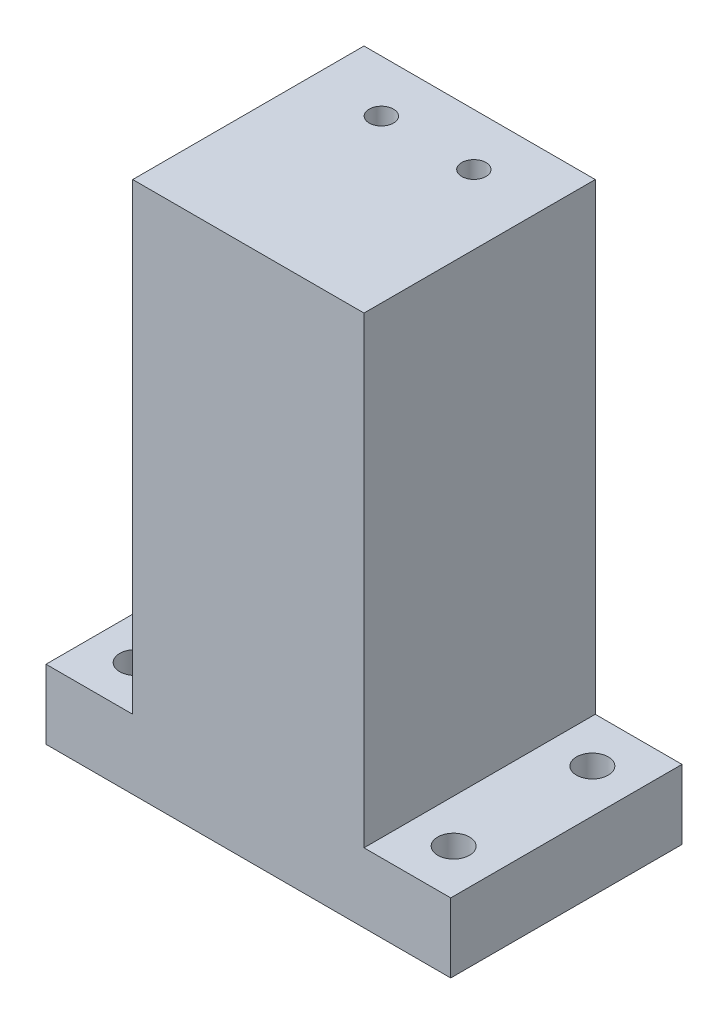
ISO-10303-21;
HEADER;
FILE_DESCRIPTION(('STEP AP214'),'2;1');
FILE_NAME('part.step','',(''),(''),'','','');
FILE_SCHEMA(('AUTOMOTIVE_DESIGN { 1 0 10303 214 1 1 1 1 }'));
ENDSEC;
DATA;
#1=APPLICATION_CONTEXT('core data for automotive mechanical design processes');
#2=APPLICATION_PROTOCOL_DEFINITION('international standard','automotive_design',2000,#1);
#3=PRODUCT_CONTEXT('',#1,'mechanical');
#4=PRODUCT('Part','Part','',(#3));
#5=PRODUCT_RELATED_PRODUCT_CATEGORY('part','',(#4));
#6=PRODUCT_DEFINITION_FORMATION('','',#4);
#7=PRODUCT_DEFINITION_CONTEXT('part definition',#1,'design');
#8=PRODUCT_DEFINITION('design','',#6,#7);
#9=PRODUCT_DEFINITION_SHAPE('','',#8);
#10=(LENGTH_UNIT() NAMED_UNIT(*) SI_UNIT(.MILLI.,.METRE.));
#11=(NAMED_UNIT(*) PLANE_ANGLE_UNIT() SI_UNIT($,.RADIAN.));
#12=(NAMED_UNIT(*) SI_UNIT($,.STERADIAN.) SOLID_ANGLE_UNIT());
#13=UNCERTAINTY_MEASURE_WITH_UNIT(LENGTH_MEASURE(1.E-05),#10,'distance_accuracy_value','');
#14=(GEOMETRIC_REPRESENTATION_CONTEXT(3) GLOBAL_UNCERTAINTY_ASSIGNED_CONTEXT((#13)) GLOBAL_UNIT_ASSIGNED_CONTEXT((#10,
#11,#12)) REPRESENTATION_CONTEXT('',''));
#15=CARTESIAN_POINT('',(0.,0.,0.));
#16=DIRECTION('',(0.,0.,1.));
#17=DIRECTION('',(1.,0.,0.));
#18=AXIS2_PLACEMENT_3D('',#15,#16,#17);
#19=CARTESIAN_POINT('',(0.,11.9999999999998,40.));
#20=DIRECTION('',(0.,-1.,0.));
#21=DIRECTION('',(0.,0.,-1.));
#22=AXIS2_PLACEMENT_3D('',#19,#20,#21);
#23=PLANE('',#22);
#24=CARTESIAN_POINT('',(7.5,11.9999999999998,8.));
#25=DIRECTION('',(0.,1.,0.));
#26=DIRECTION('',(0.,0.,1.));
#27=AXIS2_PLACEMENT_3D('',#24,#25,#26);
#28=CIRCLE('',#27,2.75);
#29=CARTESIAN_POINT('',(7.5,11.9999999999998,10.75));
#30=VERTEX_POINT('',#29);
#31=EDGE_CURVE('E170',#30,#30,#28,.T.);
#32=ORIENTED_EDGE('',*,*,#31,.F.);
#33=EDGE_LOOP('',(#32));
#34=FACE_BOUND('',#33,.T.);
#35=CARTESIAN_POINT('',(7.5,11.9999999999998,32.));
#36=DIRECTION('',(0.,1.,0.));
#37=DIRECTION('',(0.,0.,1.));
#38=AXIS2_PLACEMENT_3D('',#35,#36,#37);
#39=CIRCLE('',#38,2.75);
#40=CARTESIAN_POINT('',(7.5,11.9999999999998,34.75));
#41=VERTEX_POINT('',#40);
#42=EDGE_CURVE('E159',#41,#41,#39,.T.);
#43=ORIENTED_EDGE('',*,*,#42,.F.);
#44=EDGE_LOOP('',(#43));
#45=FACE_BOUND('',#44,.T.);
#46=DIRECTION('',(-1.,0.,0.));
#47=VECTOR('',#46,1.);
#48=CARTESIAN_POINT('',(0.,11.9999999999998,0.));
#49=LINE('',#48,#47);
#50=CARTESIAN_POINT('',(15.,11.9999999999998,0.));
#51=VERTEX_POINT('',#50);
#52=CARTESIAN_POINT('',(0.,11.9999999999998,0.));
#53=VERTEX_POINT('',#52);
#54=EDGE_CURVE('E130',#51,#53,#49,.T.);
#55=ORIENTED_EDGE('',*,*,#54,.T.);
#56=DIRECTION('',(0.,0.,-1.));
#57=VECTOR('',#56,1.);
#58=CARTESIAN_POINT('',(0.,11.9999999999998,40.));
#59=LINE('',#58,#57);
#60=CARTESIAN_POINT('',(0.,11.9999999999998,40.));
#61=VERTEX_POINT('',#60);
#62=EDGE_CURVE('E11',#61,#53,#59,.T.);
#63=ORIENTED_EDGE('',*,*,#62,.F.);
#64=DIRECTION('',(-1.,0.,0.));
#65=VECTOR('',#64,1.);
#66=CARTESIAN_POINT('',(0.,11.9999999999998,40.));
#67=LINE('',#66,#65);
#68=CARTESIAN_POINT('',(15.,11.9999999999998,40.));
#69=VERTEX_POINT('',#68);
#70=EDGE_CURVE('E145',#69,#61,#67,.T.);
#71=ORIENTED_EDGE('',*,*,#70,.F.);
#72=DIRECTION('',(0.,0.,-1.));
#73=VECTOR('',#72,1.);
#74=CARTESIAN_POINT('',(15.,11.9999999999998,40.));
#75=LINE('',#74,#73);
#76=EDGE_CURVE('E126',#69,#51,#75,.T.);
#77=ORIENTED_EDGE('',*,*,#76,.T.);
#78=EDGE_LOOP('',(#55,#63,#71,#77));
#79=FACE_BOUND('',#78,.T.);
#80=ADVANCED_FACE('F32',(#34,#45,#79),#23,.F.);
#81=CARTESIAN_POINT('',(0.,0.,40.));
#82=DIRECTION('',(1.,0.,0.));
#83=DIRECTION('',(0.,0.,-1.));
#84=AXIS2_PLACEMENT_3D('',#81,#82,#83);
#85=PLANE('',#84);
#86=DIRECTION('',(0.,-1.,0.));
#87=VECTOR('',#86,1.);
#88=CARTESIAN_POINT('',(0.,0.,0.));
#89=LINE('',#88,#87);
#90=CARTESIAN_POINT('',(0.,0.,0.));
#91=VERTEX_POINT('',#90);
#92=EDGE_CURVE('E133',#53,#91,#89,.T.);
#93=ORIENTED_EDGE('',*,*,#92,.T.);
#94=DIRECTION('',(0.,0.,-1.));
#95=VECTOR('',#94,1.);
#96=CARTESIAN_POINT('',(0.,0.,40.));
#97=LINE('',#96,#95);
#98=CARTESIAN_POINT('',(0.,0.,40.));
#99=VERTEX_POINT('',#98);
#100=EDGE_CURVE('E41',#99,#91,#97,.T.);
#101=ORIENTED_EDGE('',*,*,#100,.F.);
#102=DIRECTION('',(0.,-1.,0.));
#103=VECTOR('',#102,1.);
#104=CARTESIAN_POINT('',(0.,0.,40.));
#105=LINE('',#104,#103);
#106=EDGE_CURVE('E93',#61,#99,#105,.T.);
#107=ORIENTED_EDGE('',*,*,#106,.F.);
#108=ORIENTED_EDGE('',*,*,#62,.T.);
#109=EDGE_LOOP('',(#93,#101,#107,#108));
#110=FACE_BOUND('',#109,.T.);
#111=ADVANCED_FACE('F215',(#110),#85,.F.);
#112=CARTESIAN_POINT('',(0.,0.,40.));
#113=DIRECTION('',(0.,1.,0.));
#114=DIRECTION('',(0.,0.,1.));
#115=AXIS2_PLACEMENT_3D('',#112,#113,#114);
#116=PLANE('',#115);
#117=CARTESIAN_POINT('',(7.5,0.,8.));
#118=DIRECTION('',(0.,1.,0.));
#119=DIRECTION('',(0.,0.,1.));
#120=AXIS2_PLACEMENT_3D('',#117,#118,#119);
#121=CIRCLE('',#120,2.75);
#122=CARTESIAN_POINT('',(7.5,0.,10.75));
#123=VERTEX_POINT('',#122);
#124=EDGE_CURVE('E35',#123,#123,#121,.T.);
#125=ORIENTED_EDGE('',*,*,#124,.T.);
#126=EDGE_LOOP('',(#125));
#127=FACE_BOUND('',#126,.T.);
#128=CARTESIAN_POINT('',(7.5,0.,32.));
#129=DIRECTION('',(0.,1.,0.));
#130=DIRECTION('',(0.,0.,1.));
#131=AXIS2_PLACEMENT_3D('',#128,#129,#130);
#132=CIRCLE('',#131,2.75);
#133=CARTESIAN_POINT('',(7.5,0.,34.75));
#134=VERTEX_POINT('',#133);
#135=EDGE_CURVE('E156',#134,#134,#132,.T.);
#136=ORIENTED_EDGE('',*,*,#135,.T.);
#137=EDGE_LOOP('',(#136));
#138=FACE_BOUND('',#137,.T.);
#139=CARTESIAN_POINT('',(62.5000000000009,0.,32.));
#140=DIRECTION('',(0.,1.,0.));
#141=DIRECTION('',(0.,0.,1.));
#142=AXIS2_PLACEMENT_3D('',#139,#140,#141);
#143=CIRCLE('',#142,2.75);
#144=CARTESIAN_POINT('',(62.5000000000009,0.,34.75));
#145=VERTEX_POINT('',#144);
#146=EDGE_CURVE('E163',#145,#145,#143,.T.);
#147=ORIENTED_EDGE('',*,*,#146,.T.);
#148=EDGE_LOOP('',(#147));
#149=FACE_BOUND('',#148,.T.);
#150=CARTESIAN_POINT('',(62.5000000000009,0.,8.));
#151=DIRECTION('',(0.,1.,0.));
#152=DIRECTION('',(0.,0.,1.));
#153=AXIS2_PLACEMENT_3D('',#150,#151,#152);
#154=CIRCLE('',#153,2.75);
#155=CARTESIAN_POINT('',(62.5000000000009,0.,10.75));
#156=VERTEX_POINT('',#155);
#157=EDGE_CURVE('E134',#156,#156,#154,.T.);
#158=ORIENTED_EDGE('',*,*,#157,.T.);
#159=EDGE_LOOP('',(#158));
#160=FACE_BOUND('',#159,.T.);
#161=DIRECTION('',(1.,0.,0.));
#162=VECTOR('',#161,1.);
#163=CARTESIAN_POINT('',(0.,0.,0.));
#164=LINE('',#163,#162);
#165=CARTESIAN_POINT('',(70.0000000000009,0.,0.));
#166=VERTEX_POINT('',#165);
#167=EDGE_CURVE('E136',#91,#166,#164,.T.);
#168=ORIENTED_EDGE('',*,*,#167,.T.);
#169=DIRECTION('',(0.,0.,-1.));
#170=VECTOR('',#169,1.);
#171=CARTESIAN_POINT('',(70.0000000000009,0.,40.));
#172=LINE('',#171,#170);
#173=CARTESIAN_POINT('',(70.0000000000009,0.,40.));
#174=VERTEX_POINT('',#173);
#175=EDGE_CURVE('E152',#174,#166,#172,.T.);
#176=ORIENTED_EDGE('',*,*,#175,.F.);
#177=DIRECTION('',(1.,0.,0.));
#178=VECTOR('',#177,1.);
#179=CARTESIAN_POINT('',(0.,0.,40.));
#180=LINE('',#179,#178);
#181=EDGE_CURVE('E183',#99,#174,#180,.T.);
#182=ORIENTED_EDGE('',*,*,#181,.F.);
#183=ORIENTED_EDGE('',*,*,#100,.T.);
#184=EDGE_LOOP('',(#168,#176,#182,#183));
#185=FACE_BOUND('',#184,.T.);
#186=ADVANCED_FACE('F220',(#127,#138,#149,#160,#185),#116,.F.);
#187=CARTESIAN_POINT('',(70.0000000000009,0.,40.));
#188=DIRECTION('',(-1.,0.,0.));
#189=DIRECTION('',(0.,0.,1.));
#190=AXIS2_PLACEMENT_3D('',#187,#188,#189);
#191=PLANE('',#190);
#192=DIRECTION('',(0.,1.,0.));
#193=VECTOR('',#192,1.);
#194=CARTESIAN_POINT('',(70.0000000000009,0.,0.));
#195=LINE('',#194,#193);
#196=CARTESIAN_POINT('',(70.0000000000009,11.9999999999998,0.));
#197=VERTEX_POINT('',#196);
#198=EDGE_CURVE('E138',#166,#197,#195,.T.);
#199=ORIENTED_EDGE('',*,*,#198,.T.);
#200=DIRECTION('',(0.,0.,-1.));
#201=VECTOR('',#200,1.);
#202=CARTESIAN_POINT('',(70.0000000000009,11.9999999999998,40.));
#203=LINE('',#202,#201);
#204=CARTESIAN_POINT('',(70.0000000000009,11.9999999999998,40.));
#205=VERTEX_POINT('',#204);
#206=EDGE_CURVE('E149',#205,#197,#203,.T.);
#207=ORIENTED_EDGE('',*,*,#206,.F.);
#208=DIRECTION('',(0.,1.,0.));
#209=VECTOR('',#208,1.);
#210=CARTESIAN_POINT('',(70.0000000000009,0.,40.));
#211=LINE('',#210,#209);
#212=EDGE_CURVE('E185',#174,#205,#211,.T.);
#213=ORIENTED_EDGE('',*,*,#212,.F.);
#214=ORIENTED_EDGE('',*,*,#175,.T.);
#215=EDGE_LOOP('',(#199,#207,#213,#214));
#216=FACE_BOUND('',#215,.T.);
#217=ADVANCED_FACE('F191',(#216),#191,.F.);
#218=CARTESIAN_POINT('',(55.,11.9999999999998,40.));
#219=DIRECTION('',(0.,-1.,0.));
#220=DIRECTION('',(0.,0.,-1.));
#221=AXIS2_PLACEMENT_3D('',#218,#219,#220);
#222=PLANE('',#221);
#223=CARTESIAN_POINT('',(62.5000000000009,11.9999999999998,32.));
#224=DIRECTION('',(0.,1.,0.));
#225=DIRECTION('',(0.,0.,1.));
#226=AXIS2_PLACEMENT_3D('',#223,#224,#225);
#227=CIRCLE('',#226,2.75);
#228=CARTESIAN_POINT('',(62.5000000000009,11.9999999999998,34.75));
#229=VERTEX_POINT('',#228);
#230=EDGE_CURVE('E158',#229,#229,#227,.T.);
#231=ORIENTED_EDGE('',*,*,#230,.F.);
#232=EDGE_LOOP('',(#231));
#233=FACE_BOUND('',#232,.T.);
#234=CARTESIAN_POINT('',(62.5000000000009,11.9999999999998,8.));
#235=DIRECTION('',(0.,1.,0.));
#236=DIRECTION('',(0.,0.,1.));
#237=AXIS2_PLACEMENT_3D('',#234,#235,#236);
#238=CIRCLE('',#237,2.75);
#239=CARTESIAN_POINT('',(62.5000000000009,11.9999999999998,10.75));
#240=VERTEX_POINT('',#239);
#241=EDGE_CURVE('E176',#240,#240,#238,.T.);
#242=ORIENTED_EDGE('',*,*,#241,.F.);
#243=EDGE_LOOP('',(#242));
#244=FACE_BOUND('',#243,.T.);
#245=DIRECTION('',(-1.,0.,0.));
#246=VECTOR('',#245,1.);
#247=CARTESIAN_POINT('',(55.,11.9999999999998,0.));
#248=LINE('',#247,#246);
#249=CARTESIAN_POINT('',(55.,11.9999999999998,0.));
#250=VERTEX_POINT('',#249);
#251=EDGE_CURVE('E140',#197,#250,#248,.T.);
#252=ORIENTED_EDGE('',*,*,#251,.T.);
#253=DIRECTION('',(0.,0.,-1.));
#254=VECTOR('',#253,1.);
#255=CARTESIAN_POINT('',(55.,11.9999999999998,40.));
#256=LINE('',#255,#254);
#257=CARTESIAN_POINT('',(55.,11.9999999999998,40.));
#258=VERTEX_POINT('',#257);
#259=EDGE_CURVE('E121',#258,#250,#256,.T.);
#260=ORIENTED_EDGE('',*,*,#259,.F.);
#261=DIRECTION('',(-1.,0.,0.));
#262=VECTOR('',#261,1.);
#263=CARTESIAN_POINT('',(55.,11.9999999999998,40.));
#264=LINE('',#263,#262);
#265=EDGE_CURVE('E112',#205,#258,#264,.T.);
#266=ORIENTED_EDGE('',*,*,#265,.F.);
#267=ORIENTED_EDGE('',*,*,#206,.T.);
#268=EDGE_LOOP('',(#252,#260,#266,#267));
#269=FACE_BOUND('',#268,.T.);
#270=ADVANCED_FACE('F195',(#233,#244,#269),#222,.F.);
#271=CARTESIAN_POINT('',(55.,11.9999999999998,40.));
#272=DIRECTION('',(-1.,0.,0.));
#273=DIRECTION('',(0.,0.,1.));
#274=AXIS2_PLACEMENT_3D('',#271,#272,#273);
#275=PLANE('',#274);
#276=DIRECTION('',(0.,1.,0.));
#277=VECTOR('',#276,1.);
#278=CARTESIAN_POINT('',(55.,11.9999999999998,0.));
#279=LINE('',#278,#277);
#280=CARTESIAN_POINT('',(55.,92.1000000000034,0.));
#281=VERTEX_POINT('',#280);
#282=EDGE_CURVE('E120',#250,#281,#279,.T.);
#283=ORIENTED_EDGE('',*,*,#282,.T.);
#284=DIRECTION('',(0.,0.,-1.));
#285=VECTOR('',#284,1.);
#286=CARTESIAN_POINT('',(55.,92.1000000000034,40.));
#287=LINE('',#286,#285);
#288=CARTESIAN_POINT('',(55.,92.1000000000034,40.));
#289=VERTEX_POINT('',#288);
#290=EDGE_CURVE('E117',#289,#281,#287,.T.);
#291=ORIENTED_EDGE('',*,*,#290,.F.);
#292=DIRECTION('',(0.,1.,0.));
#293=VECTOR('',#292,1.);
#294=CARTESIAN_POINT('',(55.,11.9999999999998,40.));
#295=LINE('',#294,#293);
#296=EDGE_CURVE('E106',#258,#289,#295,.T.);
#297=ORIENTED_EDGE('',*,*,#296,.F.);
#298=ORIENTED_EDGE('',*,*,#259,.T.);
#299=EDGE_LOOP('',(#283,#291,#297,#298));
#300=FACE_BOUND('',#299,.T.);
#301=ADVANCED_FACE('F118',(#300),#275,.F.);
#302=CARTESIAN_POINT('',(15.,92.1000000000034,40.));
#303=DIRECTION('',(0.,-1.,0.));
#304=DIRECTION('',(0.,0.,-1.));
#305=AXIS2_PLACEMENT_3D('',#302,#303,#304);
#306=PLANE('',#305);
#307=CARTESIAN_POINT('',(43.,92.1000000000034,9.));
#308=DIRECTION('',(0.,1.,0.));
#309=DIRECTION('',(0.,0.,1.));
#310=AXIS2_PLACEMENT_3D('',#307,#308,#309);
#311=CIRCLE('',#310,2.09999999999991);
#312=CARTESIAN_POINT('',(43.,92.1000000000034,11.0999999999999));
#313=VERTEX_POINT('',#312);
#314=EDGE_CURVE('E234',#313,#313,#311,.T.);
#315=ORIENTED_EDGE('',*,*,#314,.F.);
#316=EDGE_LOOP('',(#315));
#317=FACE_BOUND('',#316,.T.);
#318=CARTESIAN_POINT('',(27.,92.1000000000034,9.));
#319=DIRECTION('',(0.,1.,0.));
#320=DIRECTION('',(0.,0.,1.));
#321=AXIS2_PLACEMENT_3D('',#318,#319,#320);
#322=CIRCLE('',#321,2.09999999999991);
#323=CARTESIAN_POINT('',(27.,92.1000000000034,11.0999999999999));
#324=VERTEX_POINT('',#323);
#325=EDGE_CURVE('E227',#324,#324,#322,.T.);
#326=ORIENTED_EDGE('',*,*,#325,.F.);
#327=EDGE_LOOP('',(#326));
#328=FACE_BOUND('',#327,.T.);
#329=DIRECTION('',(-1.,0.,0.));
#330=VECTOR('',#329,1.);
#331=CARTESIAN_POINT('',(15.,92.1000000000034,0.));
#332=LINE('',#331,#330);
#333=CARTESIAN_POINT('',(15.,92.1000000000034,0.));
#334=VERTEX_POINT('',#333);
#335=EDGE_CURVE('E79',#281,#334,#332,.T.);
#336=ORIENTED_EDGE('',*,*,#335,.T.);
#337=DIRECTION('',(0.,0.,-1.));
#338=VECTOR('',#337,1.);
#339=CARTESIAN_POINT('',(15.,92.1000000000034,40.));
#340=LINE('',#339,#338);
#341=CARTESIAN_POINT('',(15.,92.1000000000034,40.));
#342=VERTEX_POINT('',#341);
#343=EDGE_CURVE('E122',#342,#334,#340,.T.);
#344=ORIENTED_EDGE('',*,*,#343,.F.);
#345=DIRECTION('',(-1.,0.,0.));
#346=VECTOR('',#345,1.);
#347=CARTESIAN_POINT('',(15.,92.1000000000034,40.));
#348=LINE('',#347,#346);
#349=EDGE_CURVE('E110',#289,#342,#348,.T.);
#350=ORIENTED_EDGE('',*,*,#349,.F.);
#351=ORIENTED_EDGE('',*,*,#290,.T.);
#352=EDGE_LOOP('',(#336,#344,#350,#351));
#353=FACE_BOUND('',#352,.T.);
#354=ADVANCED_FACE('F124',(#317,#328,#353),#306,.F.);
#355=CARTESIAN_POINT('',(15.,11.9999999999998,40.));
#356=DIRECTION('',(1.,0.,0.));
#357=DIRECTION('',(0.,0.,-1.));
#358=AXIS2_PLACEMENT_3D('',#355,#356,#357);
#359=PLANE('',#358);
#360=DIRECTION('',(0.,-1.,0.));
#361=VECTOR('',#360,1.);
#362=CARTESIAN_POINT('',(15.,11.9999999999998,0.));
#363=LINE('',#362,#361);
#364=EDGE_CURVE('E85',#334,#51,#363,.T.);
#365=ORIENTED_EDGE('',*,*,#364,.T.);
#366=ORIENTED_EDGE('',*,*,#76,.F.);
#367=DIRECTION('',(0.,-1.,0.));
#368=VECTOR('',#367,1.);
#369=CARTESIAN_POINT('',(15.,11.9999999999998,40.));
#370=LINE('',#369,#368);
#371=EDGE_CURVE('E50',#342,#69,#370,.T.);
#372=ORIENTED_EDGE('',*,*,#371,.F.);
#373=ORIENTED_EDGE('',*,*,#343,.T.);
#374=EDGE_LOOP('',(#365,#366,#372,#373));
#375=FACE_BOUND('',#374,.T.);
#376=ADVANCED_FACE('F203',(#375),#359,.F.);
#377=CARTESIAN_POINT('',(15.,11.9999999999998,40.));
#378=DIRECTION('',(0.,0.,1.));
#379=DIRECTION('',(1.,0.,0.));
#380=AXIS2_PLACEMENT_3D('',#377,#378,#379);
#381=PLANE('',#380);
#382=ORIENTED_EDGE('',*,*,#70,.T.);
#383=ORIENTED_EDGE('',*,*,#106,.T.);
#384=ORIENTED_EDGE('',*,*,#181,.T.);
#385=ORIENTED_EDGE('',*,*,#212,.T.);
#386=ORIENTED_EDGE('',*,*,#265,.T.);
#387=ORIENTED_EDGE('',*,*,#296,.T.);
#388=ORIENTED_EDGE('',*,*,#349,.T.);
#389=ORIENTED_EDGE('',*,*,#371,.T.);
#390=EDGE_LOOP('',(#382,#383,#384,#385,#386,#387,#388,#389));
#391=FACE_BOUND('',#390,.T.);
#392=ADVANCED_FACE('F108',(#391),#381,.T.);
#393=CARTESIAN_POINT('',(15.,11.9999999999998,0.));
#394=DIRECTION('',(0.,0.,1.));
#395=DIRECTION('',(1.,0.,0.));
#396=AXIS2_PLACEMENT_3D('',#393,#394,#395);
#397=PLANE('',#396);
#398=ORIENTED_EDGE('',*,*,#54,.F.);
#399=ORIENTED_EDGE('',*,*,#364,.F.);
#400=ORIENTED_EDGE('',*,*,#335,.F.);
#401=ORIENTED_EDGE('',*,*,#282,.F.);
#402=ORIENTED_EDGE('',*,*,#251,.F.);
#403=ORIENTED_EDGE('',*,*,#198,.F.);
#404=ORIENTED_EDGE('',*,*,#167,.F.);
#405=ORIENTED_EDGE('',*,*,#92,.F.);
#406=EDGE_LOOP('',(#398,#399,#400,#401,#402,#403,#404,#405));
#407=FACE_BOUND('',#406,.T.);
#408=ADVANCED_FACE('F198',(#407),#397,.F.);
#409=CARTESIAN_POINT('',(62.5000000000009,-28.0000000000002,8.));
#410=DIRECTION('',(0.,1.,0.));
#411=DIRECTION('',(0.,0.,1.));
#412=AXIS2_PLACEMENT_3D('',#409,#410,#411);
#413=CYLINDRICAL_SURFACE('',#412,2.75);
#414=ORIENTED_EDGE('',*,*,#241,.T.);
#415=EDGE_LOOP('',(#414));
#416=FACE_BOUND('',#415,.T.);
#417=ORIENTED_EDGE('',*,*,#157,.F.);
#418=EDGE_LOOP('',(#417));
#419=FACE_BOUND('',#418,.T.);
#420=ADVANCED_FACE('F269',(#416,#419),#413,.F.);
#421=CARTESIAN_POINT('',(62.5000000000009,-28.0000000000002,32.));
#422=DIRECTION('',(0.,1.,0.));
#423=DIRECTION('',(0.,0.,1.));
#424=AXIS2_PLACEMENT_3D('',#421,#422,#423);
#425=CYLINDRICAL_SURFACE('',#424,2.75);
#426=ORIENTED_EDGE('',*,*,#230,.T.);
#427=EDGE_LOOP('',(#426));
#428=FACE_BOUND('',#427,.T.);
#429=ORIENTED_EDGE('',*,*,#146,.F.);
#430=EDGE_LOOP('',(#429));
#431=FACE_BOUND('',#430,.T.);
#432=ADVANCED_FACE('F266',(#428,#431),#425,.F.);
#433=CARTESIAN_POINT('',(7.5,-28.0000000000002,32.));
#434=DIRECTION('',(0.,1.,0.));
#435=DIRECTION('',(0.,0.,1.));
#436=AXIS2_PLACEMENT_3D('',#433,#434,#435);
#437=CYLINDRICAL_SURFACE('',#436,2.75);
#438=ORIENTED_EDGE('',*,*,#42,.T.);
#439=EDGE_LOOP('',(#438));
#440=FACE_BOUND('',#439,.T.);
#441=ORIENTED_EDGE('',*,*,#135,.F.);
#442=EDGE_LOOP('',(#441));
#443=FACE_BOUND('',#442,.T.);
#444=ADVANCED_FACE('F261',(#440,#443),#437,.F.);
#445=CARTESIAN_POINT('',(7.5,-28.0000000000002,8.));
#446=DIRECTION('',(0.,1.,0.));
#447=DIRECTION('',(0.,0.,1.));
#448=AXIS2_PLACEMENT_3D('',#445,#446,#447);
#449=CYLINDRICAL_SURFACE('',#448,2.75);
#450=ORIENTED_EDGE('',*,*,#31,.T.);
#451=EDGE_LOOP('',(#450));
#452=FACE_BOUND('',#451,.T.);
#453=ORIENTED_EDGE('',*,*,#124,.F.);
#454=EDGE_LOOP('',(#453));
#455=FACE_BOUND('',#454,.T.);
#456=ADVANCED_FACE('F253',(#452,#455),#449,.F.);
#457=CARTESIAN_POINT('',(27.,77.1000000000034,9.));
#458=DIRECTION('',(0.,1.,0.));
#459=DIRECTION('',(0.,0.,1.));
#460=AXIS2_PLACEMENT_3D('',#457,#458,#459);
#461=CYLINDRICAL_SURFACE('',#460,2.09999999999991);
#462=CARTESIAN_POINT('',(27.,77.1000000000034,9.));
#463=DIRECTION('',(0.,1.,0.));
#464=DIRECTION('',(0.,0.,1.));
#465=AXIS2_PLACEMENT_3D('',#462,#463,#464);
#466=CIRCLE('',#465,2.09999999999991);
#467=CARTESIAN_POINT('',(27.,77.1000000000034,11.0999999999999));
#468=VERTEX_POINT('',#467);
#469=EDGE_CURVE('E225',#468,#468,#466,.T.);
#470=ORIENTED_EDGE('',*,*,#469,.F.);
#471=EDGE_LOOP('',(#470));
#472=FACE_BOUND('',#471,.T.);
#473=ORIENTED_EDGE('',*,*,#325,.T.);
#474=EDGE_LOOP('',(#473));
#475=FACE_BOUND('',#474,.T.);
#476=ADVANCED_FACE('F251',(#472,#475),#461,.F.);
#477=CARTESIAN_POINT('',(27.,77.1000000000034,9.));
#478=DIRECTION('',(0.,1.,0.));
#479=DIRECTION('',(0.,0.,1.));
#480=AXIS2_PLACEMENT_3D('',#477,#478,#479);
#481=PLANE('',#480);
#482=ORIENTED_EDGE('',*,*,#469,.T.);
#483=EDGE_LOOP('',(#482));
#484=FACE_BOUND('',#483,.T.);
#485=ADVANCED_FACE('F245',(#484),#481,.T.);
#486=CARTESIAN_POINT('',(43.,77.1000000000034,9.));
#487=DIRECTION('',(0.,1.,0.));
#488=DIRECTION('',(0.,0.,1.));
#489=AXIS2_PLACEMENT_3D('',#486,#487,#488);
#490=CYLINDRICAL_SURFACE('',#489,2.09999999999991);
#491=CARTESIAN_POINT('',(43.,77.1000000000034,9.));
#492=DIRECTION('',(0.,1.,0.));
#493=DIRECTION('',(0.,0.,1.));
#494=AXIS2_PLACEMENT_3D('',#491,#492,#493);
#495=CIRCLE('',#494,2.09999999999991);
#496=CARTESIAN_POINT('',(43.,77.1000000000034,11.0999999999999));
#497=VERTEX_POINT('',#496);
#498=EDGE_CURVE('E232',#497,#497,#495,.T.);
#499=ORIENTED_EDGE('',*,*,#498,.F.);
#500=EDGE_LOOP('',(#499));
#501=FACE_BOUND('',#500,.T.);
#502=ORIENTED_EDGE('',*,*,#314,.T.);
#503=EDGE_LOOP('',(#502));
#504=FACE_BOUND('',#503,.T.);
#505=ADVANCED_FACE('F242',(#501,#504),#490,.F.);
#506=CARTESIAN_POINT('',(43.,77.1000000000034,9.));
#507=DIRECTION('',(0.,1.,0.));
#508=DIRECTION('',(0.,0.,1.));
#509=AXIS2_PLACEMENT_3D('',#506,#507,#508);
#510=PLANE('',#509);
#511=ORIENTED_EDGE('',*,*,#498,.T.);
#512=EDGE_LOOP('',(#511));
#513=FACE_BOUND('',#512,.T.);
#514=ADVANCED_FACE('F240',(#513),#510,.T.);
#515=CLOSED_SHELL('',(#80,#111,#186,#217,#270,#301,#354,#376,#392,#408,#420,#432,#444,#456,#476,
#485,#505,#514));
#516=MANIFOLD_SOLID_BREP('B2',#515);
#517=ADVANCED_BREP_SHAPE_REPRESENTATION('',(#18,#516),#14);
#518=SHAPE_DEFINITION_REPRESENTATION(#9,#517);
ENDSEC;
END-ISO-10303-21;
